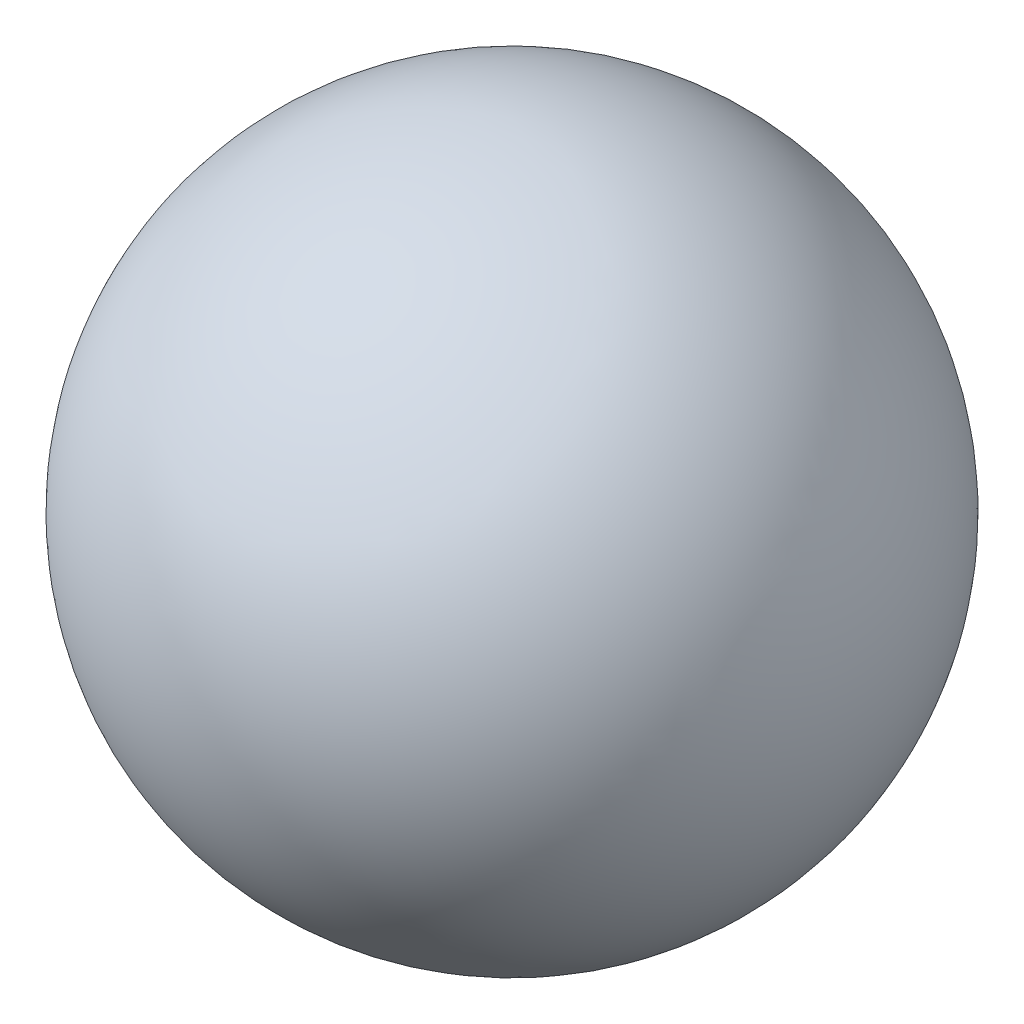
ISO-10303-21;
HEADER;
FILE_DESCRIPTION(('STEP AP214'),'2;1');
FILE_NAME('part.step','',(''),(''),'','','');
FILE_SCHEMA(('AUTOMOTIVE_DESIGN { 1 0 10303 214 1 1 1 1 }'));
ENDSEC;
DATA;
#1=APPLICATION_CONTEXT('core data for automotive mechanical design processes');
#2=APPLICATION_PROTOCOL_DEFINITION('international standard','automotive_design',2000,#1);
#3=PRODUCT_CONTEXT('',#1,'mechanical');
#4=PRODUCT('Part','Part','',(#3));
#5=PRODUCT_RELATED_PRODUCT_CATEGORY('part','',(#4));
#6=PRODUCT_DEFINITION_FORMATION('','',#4);
#7=PRODUCT_DEFINITION_CONTEXT('part definition',#1,'design');
#8=PRODUCT_DEFINITION('design','',#6,#7);
#9=PRODUCT_DEFINITION_SHAPE('','',#8);
#10=(LENGTH_UNIT() NAMED_UNIT(*) SI_UNIT(.MILLI.,.METRE.));
#11=(NAMED_UNIT(*) PLANE_ANGLE_UNIT() SI_UNIT($,.RADIAN.));
#12=(NAMED_UNIT(*) SI_UNIT($,.STERADIAN.) SOLID_ANGLE_UNIT());
#13=UNCERTAINTY_MEASURE_WITH_UNIT(LENGTH_MEASURE(1.E-05),#10,'distance_accuracy_value','');
#14=(GEOMETRIC_REPRESENTATION_CONTEXT(3) GLOBAL_UNCERTAINTY_ASSIGNED_CONTEXT((#13)) GLOBAL_UNIT_ASSIGNED_CONTEXT((#10,
#11,#12)) REPRESENTATION_CONTEXT('',''));
#15=CARTESIAN_POINT('',(0.,0.,0.));
#16=DIRECTION('',(0.,0.,1.));
#17=DIRECTION('',(1.,0.,0.));
#18=AXIS2_PLACEMENT_3D('',#15,#16,#17);
#19=CARTESIAN_POINT('',(13.,0.,-15.5));
#20=DIRECTION('',(-1.,0.,0.));
#21=DIRECTION('',(0.,0.,-1.));
#22=AXIS2_PLACEMENT_3D('',#19,#20,#21);
#23=SPHERICAL_SURFACE('',#22,10.5);
#24=CARTESIAN_POINT('',(2.5,0.,-15.5));
#25=VERTEX_POINT('',#24);
#26=VERTEX_LOOP('',#25);
#27=FACE_BOUND('',#26,.T.);
#28=ADVANCED_FACE('F27',(#27),#23,.T.);
#29=CLOSED_SHELL('',(#28));
#30=MANIFOLD_SOLID_BREP('B2',#29);
#31=ADVANCED_BREP_SHAPE_REPRESENTATION('',(#18,#30),#14);
#32=SHAPE_DEFINITION_REPRESENTATION(#9,#31);
ENDSEC;
END-ISO-10303-21;
